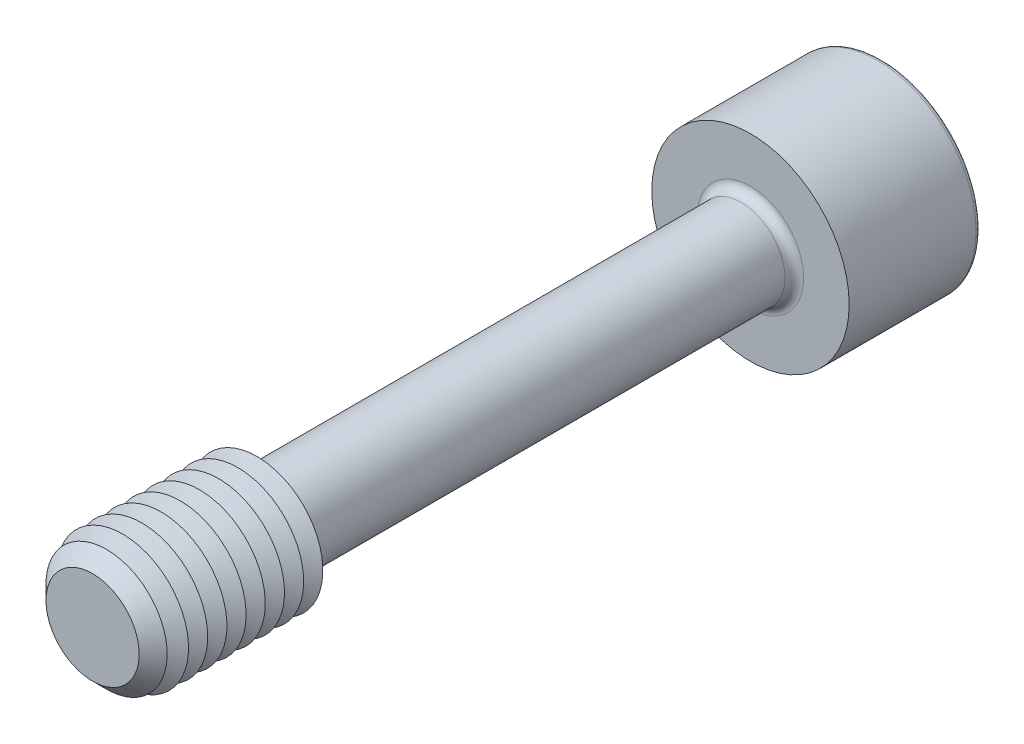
ISO-10303-21;
HEADER;
FILE_DESCRIPTION(('STEP AP214'),'2;1');
FILE_NAME('part.step','',(''),(''),'','','');
FILE_SCHEMA(('AUTOMOTIVE_DESIGN { 1 0 10303 214 1 1 1 1 }'));
ENDSEC;
DATA;
#1=APPLICATION_CONTEXT('core data for automotive mechanical design processes');
#2=APPLICATION_PROTOCOL_DEFINITION('international standard','automotive_design',2000,#1);
#3=PRODUCT_CONTEXT('',#1,'mechanical');
#4=PRODUCT('Part','Part','',(#3));
#5=PRODUCT_RELATED_PRODUCT_CATEGORY('part','',(#4));
#6=PRODUCT_DEFINITION_FORMATION('','',#4);
#7=PRODUCT_DEFINITION_CONTEXT('part definition',#1,'design');
#8=PRODUCT_DEFINITION('design','',#6,#7);
#9=PRODUCT_DEFINITION_SHAPE('','',#8);
#10=(LENGTH_UNIT() NAMED_UNIT(*) SI_UNIT(.MILLI.,.METRE.));
#11=(NAMED_UNIT(*) PLANE_ANGLE_UNIT() SI_UNIT($,.RADIAN.));
#12=(NAMED_UNIT(*) SI_UNIT($,.STERADIAN.) SOLID_ANGLE_UNIT());
#13=UNCERTAINTY_MEASURE_WITH_UNIT(LENGTH_MEASURE(1.E-05),#10,'distance_accuracy_value','');
#14=(GEOMETRIC_REPRESENTATION_CONTEXT(3) GLOBAL_UNCERTAINTY_ASSIGNED_CONTEXT((#13)) GLOBAL_UNIT_ASSIGNED_CONTEXT((#10,
#11,#12)) REPRESENTATION_CONTEXT('',''));
#15=CARTESIAN_POINT('',(0.,0.,0.));
#16=DIRECTION('',(0.,0.,1.));
#17=DIRECTION('',(1.,0.,0.));
#18=AXIS2_PLACEMENT_3D('',#15,#16,#17);
#19=CARTESIAN_POINT('',(-2.88675134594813,-5.,-32.));
#20=DIRECTION('',(0.,0.,1.));
#21=DIRECTION('',(1.,0.,0.));
#22=AXIS2_PLACEMENT_3D('',#19,#20,#21);
#23=PLANE('',#22);
#24=DIRECTION('',(1.,0.,0.));
#25=VECTOR('',#24,1.);
#26=CARTESIAN_POINT('',(-2.88675134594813,-5.,-32.));
#27=LINE('',#26,#25);
#28=CARTESIAN_POINT('',(0.,-5.,-32.));
#29=VERTEX_POINT('',#28);
#30=CARTESIAN_POINT('',(2.88675134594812,-5.,-32.));
#31=VERTEX_POINT('',#30);
#32=EDGE_CURVE('E762',#29,#31,#27,.T.);
#33=ORIENTED_EDGE('',*,*,#32,.F.);
#34=CARTESIAN_POINT('',(0.,0.,-32.));
#35=DIRECTION('',(0.,0.,1.));
#36=DIRECTION('',(0.,-1.,0.));
#37=AXIS2_PLACEMENT_3D('',#34,#35,#36);
#38=CIRCLE('',#37,5.);
#39=CARTESIAN_POINT('',(4.3301270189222,-2.5,-32.));
#40=VERTEX_POINT('',#39);
#41=EDGE_CURVE('E53',#29,#40,#38,.T.);
#42=ORIENTED_EDGE('',*,*,#41,.T.);
#43=DIRECTION('',(0.5,0.866025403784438,0.));
#44=VECTOR('',#43,1.);
#45=CARTESIAN_POINT('',(2.88675134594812,-5.,-32.));
#46=LINE('',#45,#44);
#47=EDGE_CURVE('E747',#31,#40,#46,.T.);
#48=ORIENTED_EDGE('',*,*,#47,.F.);
#49=EDGE_LOOP('',(#33,#42,#48));
#50=FACE_BOUND('',#49,.T.);
#51=ADVANCED_FACE('F41',(#50),#23,.F.);
#52=CARTESIAN_POINT('',(5.77350269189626,0.,-32.));
#53=VERTEX_POINT('',#52);
#54=EDGE_CURVE('E758',#40,#53,#46,.T.);
#55=ORIENTED_EDGE('',*,*,#54,.F.);
#56=CARTESIAN_POINT('',(4.3301270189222,2.50000000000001,-32.));
#57=VERTEX_POINT('',#56);
#58=EDGE_CURVE('E11',#40,#57,#38,.T.);
#59=ORIENTED_EDGE('',*,*,#58,.T.);
#60=DIRECTION('',(-0.5,0.866025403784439,0.));
#61=VECTOR('',#60,1.);
#62=CARTESIAN_POINT('',(5.77350269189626,0.,-32.));
#63=LINE('',#62,#61);
#64=EDGE_CURVE('E746',#53,#57,#63,.T.);
#65=ORIENTED_EDGE('',*,*,#64,.F.);
#66=EDGE_LOOP('',(#55,#59,#65));
#67=FACE_BOUND('',#66,.T.);
#68=ADVANCED_FACE('F133',(#67),#23,.F.);
#69=CARTESIAN_POINT('',(2.88675134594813,5.,-32.));
#70=VERTEX_POINT('',#69);
#71=EDGE_CURVE('E741',#57,#70,#63,.T.);
#72=ORIENTED_EDGE('',*,*,#71,.F.);
#73=CARTESIAN_POINT('',(0.,5.00000000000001,-32.));
#74=VERTEX_POINT('',#73);
#75=EDGE_CURVE('E51',#57,#74,#38,.T.);
#76=ORIENTED_EDGE('',*,*,#75,.T.);
#77=DIRECTION('',(-1.,0.,0.));
#78=VECTOR('',#77,1.);
#79=CARTESIAN_POINT('',(2.88675134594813,5.,-32.));
#80=LINE('',#79,#78);
#81=EDGE_CURVE('E177',#70,#74,#80,.T.);
#82=ORIENTED_EDGE('',*,*,#81,.F.);
#83=EDGE_LOOP('',(#72,#76,#82));
#84=FACE_BOUND('',#83,.T.);
#85=ADVANCED_FACE('F139',(#84),#23,.F.);
#86=CARTESIAN_POINT('',(-2.88675134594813,5.,-32.));
#87=VERTEX_POINT('',#86);
#88=EDGE_CURVE('E752',#74,#87,#80,.T.);
#89=ORIENTED_EDGE('',*,*,#88,.F.);
#90=CARTESIAN_POINT('',(-4.3301270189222,2.50000000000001,-32.));
#91=VERTEX_POINT('',#90);
#92=EDGE_CURVE('E265',#74,#91,#38,.T.);
#93=ORIENTED_EDGE('',*,*,#92,.T.);
#94=DIRECTION('',(-0.5,-0.866025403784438,0.));
#95=VECTOR('',#94,1.);
#96=CARTESIAN_POINT('',(-2.88675134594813,5.,-32.));
#97=LINE('',#96,#95);
#98=EDGE_CURVE('E176',#87,#91,#97,.T.);
#99=ORIENTED_EDGE('',*,*,#98,.F.);
#100=EDGE_LOOP('',(#89,#93,#99));
#101=FACE_BOUND('',#100,.T.);
#102=ADVANCED_FACE('F157',(#101),#23,.F.);
#103=CARTESIAN_POINT('',(-5.77350269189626,0.,-32.));
#104=VERTEX_POINT('',#103);
#105=EDGE_CURVE('E170',#91,#104,#97,.T.);
#106=ORIENTED_EDGE('',*,*,#105,.F.);
#107=CARTESIAN_POINT('',(-4.3301270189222,-2.5,-32.));
#108=VERTEX_POINT('',#107);
#109=EDGE_CURVE('E172',#91,#108,#38,.T.);
#110=ORIENTED_EDGE('',*,*,#109,.T.);
#111=DIRECTION('',(0.5,-0.866025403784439,0.));
#112=VECTOR('',#111,1.);
#113=CARTESIAN_POINT('',(-5.77350269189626,0.,-32.));
#114=LINE('',#113,#112);
#115=EDGE_CURVE('E174',#104,#108,#114,.T.);
#116=ORIENTED_EDGE('',*,*,#115,.F.);
#117=EDGE_LOOP('',(#106,#110,#116));
#118=FACE_BOUND('',#117,.T.);
#119=ADVANCED_FACE('F146',(#118),#23,.F.);
#120=CARTESIAN_POINT('',(0.,0.,-42.));
#121=DIRECTION('',(0.,0.,-1.));
#122=DIRECTION('',(-1.,0.,0.));
#123=AXIS2_PLACEMENT_3D('',#120,#121,#122);
#124=PLANE('',#123);
#125=CARTESIAN_POINT('',(0.,0.,-42.));
#126=DIRECTION('',(0.,0.,-1.));
#127=DIRECTION('',(-1.,0.,0.));
#128=AXIS2_PLACEMENT_3D('',#125,#126,#127);
#129=CIRCLE('',#128,8.575);
#130=CARTESIAN_POINT('',(-8.575,0.,-42.));
#131=VERTEX_POINT('',#130);
#132=EDGE_CURVE('E251',#131,#131,#129,.T.);
#133=ORIENTED_EDGE('',*,*,#132,.T.);
#134=EDGE_LOOP('',(#133));
#135=FACE_BOUND('',#134,.T.);
#136=DIRECTION('',(-0.5,-0.866025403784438,0.));
#137=VECTOR('',#136,1.);
#138=CARTESIAN_POINT('',(-2.88675134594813,5.,-42.));
#139=LINE('',#138,#137);
#140=CARTESIAN_POINT('',(-2.88675134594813,5.,-42.));
#141=VERTEX_POINT('',#140);
#142=CARTESIAN_POINT('',(-5.77350269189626,0.,-42.));
#143=VERTEX_POINT('',#142);
#144=EDGE_CURVE('E212',#141,#143,#139,.T.);
#145=ORIENTED_EDGE('',*,*,#144,.T.);
#146=DIRECTION('',(0.5,-0.866025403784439,0.));
#147=VECTOR('',#146,1.);
#148=CARTESIAN_POINT('',(-5.77350269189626,0.,-42.));
#149=LINE('',#148,#147);
#150=CARTESIAN_POINT('',(-2.88675134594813,-5.,-42.));
#151=VERTEX_POINT('',#150);
#152=EDGE_CURVE('E67',#143,#151,#149,.T.);
#153=ORIENTED_EDGE('',*,*,#152,.T.);
#154=DIRECTION('',(1.,0.,0.));
#155=VECTOR('',#154,1.);
#156=CARTESIAN_POINT('',(-2.88675134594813,-5.,-42.));
#157=LINE('',#156,#155);
#158=CARTESIAN_POINT('',(2.88675134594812,-5.,-42.));
#159=VERTEX_POINT('',#158);
#160=EDGE_CURVE('E196',#151,#159,#157,.T.);
#161=ORIENTED_EDGE('',*,*,#160,.T.);
#162=DIRECTION('',(0.5,0.866025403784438,0.));
#163=VECTOR('',#162,1.);
#164=CARTESIAN_POINT('',(2.88675134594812,-5.,-42.));
#165=LINE('',#164,#163);
#166=CARTESIAN_POINT('',(5.77350269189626,0.,-42.));
#167=VERTEX_POINT('',#166);
#168=EDGE_CURVE('E200',#159,#167,#165,.T.);
#169=ORIENTED_EDGE('',*,*,#168,.T.);
#170=DIRECTION('',(-0.5,0.866025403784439,0.));
#171=VECTOR('',#170,1.);
#172=CARTESIAN_POINT('',(5.77350269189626,0.,-42.));
#173=LINE('',#172,#171);
#174=CARTESIAN_POINT('',(2.88675134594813,5.,-42.));
#175=VERTEX_POINT('',#174);
#176=EDGE_CURVE('E204',#167,#175,#173,.T.);
#177=ORIENTED_EDGE('',*,*,#176,.T.);
#178=DIRECTION('',(-1.,0.,0.));
#179=VECTOR('',#178,1.);
#180=CARTESIAN_POINT('',(2.88675134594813,5.,-42.));
#181=LINE('',#180,#179);
#182=EDGE_CURVE('E208',#175,#141,#181,.T.);
#183=ORIENTED_EDGE('',*,*,#182,.T.);
#184=EDGE_LOOP('',(#145,#153,#161,#169,#177,#183));
#185=FACE_BOUND('',#184,.T.);
#186=ADVANCED_FACE('F156',(#135,#185),#124,.T.);
#187=CARTESIAN_POINT('',(0.,0.,30.));
#188=DIRECTION('',(0.,0.,-1.));
#189=DIRECTION('',(-1.,0.,0.));
#190=AXIS2_PLACEMENT_3D('',#187,#188,#189);
#191=CYLINDRICAL_SURFACE('',#190,4.);
#192=CARTESIAN_POINT('',(0.,0.,-29.15));
#193=DIRECTION('',(0.,0.,-1.));
#194=DIRECTION('',(-1.,0.,0.));
#195=AXIS2_PLACEMENT_3D('',#192,#193,#194);
#196=CIRCLE('',#195,4.);
#197=CARTESIAN_POINT('',(-4.,0.,-29.15));
#198=VERTEX_POINT('',#197);
#199=EDGE_CURVE('E247',#198,#198,#196,.F.);
#200=ORIENTED_EDGE('',*,*,#199,.T.);
#201=EDGE_LOOP('',(#200));
#202=FACE_BOUND('',#201,.T.);
#203=CARTESIAN_POINT('',(0.,0.,13.8452994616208));
#204=DIRECTION('',(0.,0.,-1.));
#205=DIRECTION('',(0.,1.,0.));
#206=AXIS2_PLACEMENT_3D('',#203,#204,#205);
#207=CIRCLE('',#206,4.);
#208=CARTESIAN_POINT('',(0.,4.,13.8452994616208));
#209=VERTEX_POINT('',#208);
#210=EDGE_CURVE('E235',#209,#209,#207,.T.);
#211=ORIENTED_EDGE('',*,*,#210,.T.);
#212=EDGE_LOOP('',(#211));
#213=FACE_BOUND('',#212,.T.);
#214=ADVANCED_FACE('F163',(#202,#213),#191,.T.);
#215=CARTESIAN_POINT('',(0.,0.,13.8452994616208));
#216=DIRECTION('',(0.,0.,1.));
#217=DIRECTION('',(0.,-1.,0.));
#218=AXIS2_PLACEMENT_3D('',#215,#216,#217);
#219=CONICAL_SURFACE('',#218,4.,1.0471975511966);
#220=CARTESIAN_POINT('',(0.,0.,15.));
#221=DIRECTION('',(0.,0.,-1.));
#222=DIRECTION('',(-1.,0.,0.));
#223=AXIS2_PLACEMENT_3D('',#220,#221,#222);
#224=CIRCLE('',#223,6.);
#225=CARTESIAN_POINT('',(-6.,0.,15.));
#226=VERTEX_POINT('',#225);
#227=EDGE_CURVE('E269',#226,#226,#224,.T.);
#228=ORIENTED_EDGE('',*,*,#227,.T.);
#229=EDGE_LOOP('',(#228));
#230=FACE_BOUND('',#229,.T.);
#231=ORIENTED_EDGE('',*,*,#210,.F.);
#232=EDGE_LOOP('',(#231));
#233=FACE_BOUND('',#232,.T.);
#234=ADVANCED_FACE('F510',(#230,#233),#219,.T.);
#235=CARTESIAN_POINT('',(0.,0.,-30.));
#236=DIRECTION('',(0.,0.,-1.));
#237=DIRECTION('',(-1.,0.,0.));
#238=AXIS2_PLACEMENT_3D('',#235,#236,#237);
#239=PLANE('',#238);
#240=CARTESIAN_POINT('',(0.,0.,-30.));
#241=DIRECTION('',(0.,0.,-1.));
#242=DIRECTION('',(-1.,0.,0.));
#243=AXIS2_PLACEMENT_3D('',#240,#241,#242);
#244=CIRCLE('',#243,4.85);
#245=CARTESIAN_POINT('',(-4.85,0.,-30.));
#246=VERTEX_POINT('',#245);
#247=EDGE_CURVE('E243',#246,#246,#244,.T.);
#248=ORIENTED_EDGE('',*,*,#247,.T.);
#249=EDGE_LOOP('',(#248));
#250=FACE_BOUND('',#249,.T.);
#251=CARTESIAN_POINT('',(0.,0.,-30.));
#252=DIRECTION('',(0.,0.,-1.));
#253=DIRECTION('',(-1.,0.,0.));
#254=AXIS2_PLACEMENT_3D('',#251,#252,#253);
#255=CIRCLE('',#254,9.);
#256=CARTESIAN_POINT('',(-9.,0.,-30.));
#257=VERTEX_POINT('',#256);
#258=EDGE_CURVE('E231',#257,#257,#255,.T.);
#259=ORIENTED_EDGE('',*,*,#258,.F.);
#260=EDGE_LOOP('',(#259));
#261=FACE_BOUND('',#260,.T.);
#262=ADVANCED_FACE('F503',(#250,#261),#239,.F.);
#263=CARTESIAN_POINT('',(0.,0.,-42.));
#264=DIRECTION('',(0.,0.,1.));
#265=DIRECTION('',(1.,0.,0.));
#266=AXIS2_PLACEMENT_3D('',#263,#264,#265);
#267=CYLINDRICAL_SURFACE('',#266,9.);
#268=CARTESIAN_POINT('',(0.,0.,-41.575));
#269=DIRECTION('',(0.,0.,-1.));
#270=DIRECTION('',(-1.,0.,0.));
#271=AXIS2_PLACEMENT_3D('',#268,#269,#270);
#272=CIRCLE('',#271,9.);
#273=CARTESIAN_POINT('',(-9.,0.,-41.575));
#274=VERTEX_POINT('',#273);
#275=EDGE_CURVE('E254',#274,#274,#272,.F.);
#276=ORIENTED_EDGE('',*,*,#275,.T.);
#277=EDGE_LOOP('',(#276));
#278=FACE_BOUND('',#277,.T.);
#279=ORIENTED_EDGE('',*,*,#258,.T.);
#280=EDGE_LOOP('',(#279));
#281=FACE_BOUND('',#280,.T.);
#282=ADVANCED_FACE('F509',(#278,#281),#267,.T.);
#283=CARTESIAN_POINT('',(-5.77350269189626,0.,-32.));
#284=DIRECTION('',(0.866025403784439,0.5,0.));
#285=DIRECTION('',(-0.5,0.866025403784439,0.));
#286=AXIS2_PLACEMENT_3D('',#283,#284,#285);
#287=PLANE('',#286);
#288=ORIENTED_EDGE('',*,*,#152,.F.);
#289=DIRECTION('',(0.,0.,-1.));
#290=VECTOR('',#289,1.);
#291=CARTESIAN_POINT('',(-5.77350269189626,0.,-32.));
#292=LINE('',#291,#290);
#293=EDGE_CURVE('E186',#104,#143,#292,.T.);
#294=ORIENTED_EDGE('',*,*,#293,.F.);
#295=ORIENTED_EDGE('',*,*,#115,.T.);
#296=CARTESIAN_POINT('',(-2.88675134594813,-5.,-32.));
#297=VERTEX_POINT('',#296);
#298=EDGE_CURVE('E215',#108,#297,#114,.T.);
#299=ORIENTED_EDGE('',*,*,#298,.T.);
#300=DIRECTION('',(0.,0.,-1.));
#301=VECTOR('',#300,1.);
#302=CARTESIAN_POINT('',(-2.88675134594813,-5.,-32.));
#303=LINE('',#302,#301);
#304=EDGE_CURVE('E228',#297,#151,#303,.T.);
#305=ORIENTED_EDGE('',*,*,#304,.T.);
#306=EDGE_LOOP('',(#288,#294,#295,#299,#305));
#307=FACE_BOUND('',#306,.T.);
#308=ADVANCED_FACE('F521',(#307),#287,.T.);
#309=CARTESIAN_POINT('',(-2.88675134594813,-5.,-32.));
#310=DIRECTION('',(0.,1.,0.));
#311=DIRECTION('',(0.,0.,1.));
#312=AXIS2_PLACEMENT_3D('',#309,#310,#311);
#313=PLANE('',#312);
#314=ORIENTED_EDGE('',*,*,#160,.F.);
#315=ORIENTED_EDGE('',*,*,#304,.F.);
#316=EDGE_CURVE('E759',#297,#29,#27,.T.);
#317=ORIENTED_EDGE('',*,*,#316,.T.);
#318=ORIENTED_EDGE('',*,*,#32,.T.);
#319=DIRECTION('',(0.,0.,-1.));
#320=VECTOR('',#319,1.);
#321=CARTESIAN_POINT('',(2.88675134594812,-5.,-32.));
#322=LINE('',#321,#320);
#323=EDGE_CURVE('E225',#31,#159,#322,.T.);
#324=ORIENTED_EDGE('',*,*,#323,.T.);
#325=EDGE_LOOP('',(#314,#315,#317,#318,#324));
#326=FACE_BOUND('',#325,.T.);
#327=ADVANCED_FACE('F537',(#326),#313,.T.);
#328=CARTESIAN_POINT('',(2.88675134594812,-5.,-32.));
#329=DIRECTION('',(-0.866025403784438,0.5,0.));
#330=DIRECTION('',(-0.5,-0.866025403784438,0.));
#331=AXIS2_PLACEMENT_3D('',#328,#329,#330);
#332=PLANE('',#331);
#333=ORIENTED_EDGE('',*,*,#168,.F.);
#334=ORIENTED_EDGE('',*,*,#323,.F.);
#335=ORIENTED_EDGE('',*,*,#47,.T.);
#336=ORIENTED_EDGE('',*,*,#54,.T.);
#337=DIRECTION('',(0.,0.,-1.));
#338=VECTOR('',#337,1.);
#339=CARTESIAN_POINT('',(5.77350269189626,0.,-32.));
#340=LINE('',#339,#338);
#341=EDGE_CURVE('E222',#53,#167,#340,.T.);
#342=ORIENTED_EDGE('',*,*,#341,.T.);
#343=EDGE_LOOP('',(#333,#334,#335,#336,#342));
#344=FACE_BOUND('',#343,.T.);
#345=ADVANCED_FACE('F547',(#344),#332,.T.);
#346=CARTESIAN_POINT('',(5.77350269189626,0.,-32.));
#347=DIRECTION('',(-0.866025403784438,-0.5,0.));
#348=DIRECTION('',(0.5,-0.866025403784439,0.));
#349=AXIS2_PLACEMENT_3D('',#346,#347,#348);
#350=PLANE('',#349);
#351=ORIENTED_EDGE('',*,*,#176,.F.);
#352=ORIENTED_EDGE('',*,*,#341,.F.);
#353=ORIENTED_EDGE('',*,*,#64,.T.);
#354=ORIENTED_EDGE('',*,*,#71,.T.);
#355=DIRECTION('',(0.,0.,-1.));
#356=VECTOR('',#355,1.);
#357=CARTESIAN_POINT('',(2.88675134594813,5.,-32.));
#358=LINE('',#357,#356);
#359=EDGE_CURVE('E219',#70,#175,#358,.T.);
#360=ORIENTED_EDGE('',*,*,#359,.T.);
#361=EDGE_LOOP('',(#351,#352,#353,#354,#360));
#362=FACE_BOUND('',#361,.T.);
#363=ADVANCED_FACE('F557',(#362),#350,.T.);
#364=CARTESIAN_POINT('',(2.88675134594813,5.,-32.));
#365=DIRECTION('',(0.,-1.,0.));
#366=DIRECTION('',(0.,0.,-1.));
#367=AXIS2_PLACEMENT_3D('',#364,#365,#366);
#368=PLANE('',#367);
#369=ORIENTED_EDGE('',*,*,#182,.F.);
#370=ORIENTED_EDGE('',*,*,#359,.F.);
#371=ORIENTED_EDGE('',*,*,#81,.T.);
#372=ORIENTED_EDGE('',*,*,#88,.T.);
#373=DIRECTION('',(0.,0.,-1.));
#374=VECTOR('',#373,1.);
#375=CARTESIAN_POINT('',(-2.88675134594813,5.,-32.));
#376=LINE('',#375,#374);
#377=EDGE_CURVE('E182',#87,#141,#376,.T.);
#378=ORIENTED_EDGE('',*,*,#377,.T.);
#379=EDGE_LOOP('',(#369,#370,#371,#372,#378));
#380=FACE_BOUND('',#379,.T.);
#381=ADVANCED_FACE('F152',(#380),#368,.T.);
#382=CARTESIAN_POINT('',(-2.88675134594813,5.,-32.));
#383=DIRECTION('',(0.866025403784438,-0.5,0.));
#384=DIRECTION('',(0.5,0.866025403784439,0.));
#385=AXIS2_PLACEMENT_3D('',#382,#383,#384);
#386=PLANE('',#385);
#387=ORIENTED_EDGE('',*,*,#144,.F.);
#388=ORIENTED_EDGE('',*,*,#377,.F.);
#389=ORIENTED_EDGE('',*,*,#98,.T.);
#390=ORIENTED_EDGE('',*,*,#105,.T.);
#391=ORIENTED_EDGE('',*,*,#293,.T.);
#392=EDGE_LOOP('',(#387,#388,#389,#390,#391));
#393=FACE_BOUND('',#392,.T.);
#394=ADVANCED_FACE('F144',(#393),#386,.T.);
#395=ORIENTED_EDGE('',*,*,#298,.F.);
#396=EDGE_CURVE('E257',#108,#29,#38,.T.);
#397=ORIENTED_EDGE('',*,*,#396,.T.);
#398=ORIENTED_EDGE('',*,*,#316,.F.);
#399=EDGE_LOOP('',(#395,#397,#398));
#400=FACE_BOUND('',#399,.T.);
#401=ADVANCED_FACE('F135',(#400),#23,.F.);
#402=CARTESIAN_POINT('',(0.,0.,-29.15));
#403=DIRECTION('',(0.,0.,-1.));
#404=DIRECTION('',(-1.,0.,0.));
#405=AXIS2_PLACEMENT_3D('',#402,#403,#404);
#406=TOROIDAL_SURFACE('',#405,4.85,0.85);
#407=ORIENTED_EDGE('',*,*,#199,.F.);
#408=EDGE_LOOP('',(#407));
#409=FACE_BOUND('',#408,.T.);
#410=ORIENTED_EDGE('',*,*,#247,.F.);
#411=EDGE_LOOP('',(#410));
#412=FACE_BOUND('',#411,.T.);
#413=ADVANCED_FACE('F129',(#409,#412),#406,.F.);
#414=CARTESIAN_POINT('',(0.,0.,-41.575));
#415=DIRECTION('',(0.,0.,-1.));
#416=DIRECTION('',(-1.,0.,0.));
#417=AXIS2_PLACEMENT_3D('',#414,#415,#416);
#418=TOROIDAL_SURFACE('',#417,8.575,0.425);
#419=ORIENTED_EDGE('',*,*,#275,.F.);
#420=EDGE_LOOP('',(#419));
#421=FACE_BOUND('',#420,.T.);
#422=ORIENTED_EDGE('',*,*,#132,.F.);
#423=EDGE_LOOP('',(#422));
#424=FACE_BOUND('',#423,.T.);
#425=ADVANCED_FACE('F43',(#421,#424),#418,.T.);
#426=CARTESIAN_POINT('',(0.,0.,-29.1132486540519));
#427=DIRECTION('',(0.,0.,-1.));
#428=DIRECTION('',(0.,1.,0.));
#429=AXIS2_PLACEMENT_3D('',#426,#427,#428);
#430=CONICAL_SURFACE('',#429,0.,1.0471975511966);
#431=ORIENTED_EDGE('',*,*,#41,.F.);
#432=ORIENTED_EDGE('',*,*,#396,.F.);
#433=ORIENTED_EDGE('',*,*,#109,.F.);
#434=ORIENTED_EDGE('',*,*,#92,.F.);
#435=ORIENTED_EDGE('',*,*,#75,.F.);
#436=ORIENTED_EDGE('',*,*,#58,.F.);
#437=EDGE_LOOP('',(#431,#432,#433,#434,#435,#436));
#438=FACE_BOUND('',#437,.T.);
#439=CARTESIAN_POINT('',(0.,0.,-29.1132486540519));
#440=VERTEX_POINT('',#439);
#441=VERTEX_LOOP('',#440);
#442=FACE_BOUND('',#441,.T.);
#443=ADVANCED_FACE('F118',(#438,#442),#430,.F.);
#444=CARTESIAN_POINT('',(0.,0.,15.875));
#445=DIRECTION('',(0.,0.,-1.));
#446=DIRECTION('',(-1.,0.,0.));
#447=AXIS2_PLACEMENT_3D('',#444,#445,#446);
#448=CONICAL_SURFACE('',#447,4.48445554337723,1.0471975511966);
#449=ORIENTED_EDGE('',*,*,#227,.F.);
#450=EDGE_LOOP('',(#449));
#451=FACE_BOUND('',#450,.T.);
#452=CARTESIAN_POINT('',(0.,0.,15.875));
#453=DIRECTION('',(0.,0.,-1.));
#454=DIRECTION('',(-1.,0.,0.));
#455=AXIS2_PLACEMENT_3D('',#452,#453,#454);
#456=CIRCLE('',#455,4.48445554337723);
#457=CARTESIAN_POINT('',(-4.48445554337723,0.,15.875));
#458=VERTEX_POINT('',#457);
#459=EDGE_CURVE('E275',#458,#458,#456,.T.);
#460=ORIENTED_EDGE('',*,*,#459,.T.);
#461=EDGE_LOOP('',(#460));
#462=FACE_BOUND('',#461,.T.);
#463=ADVANCED_FACE('F120',(#451,#462),#448,.T.);
#464=CARTESIAN_POINT('',(0.,0.,16.75));
#465=DIRECTION('',(0.,0.,1.));
#466=DIRECTION('',(1.,0.,0.));
#467=AXIS2_PLACEMENT_3D('',#464,#465,#466);
#468=CONICAL_SURFACE('',#467,6.,1.0471975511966);
#469=ORIENTED_EDGE('',*,*,#459,.F.);
#470=EDGE_LOOP('',(#469));
#471=FACE_BOUND('',#470,.T.);
#472=CARTESIAN_POINT('',(0.,0.,16.75));
#473=DIRECTION('',(0.,0.,-1.));
#474=DIRECTION('',(-1.,0.,0.));
#475=AXIS2_PLACEMENT_3D('',#472,#473,#474);
#476=CIRCLE('',#475,6.);
#477=CARTESIAN_POINT('',(-6.,0.,16.75));
#478=VERTEX_POINT('',#477);
#479=EDGE_CURVE('E280',#478,#478,#476,.T.);
#480=ORIENTED_EDGE('',*,*,#479,.T.);
#481=EDGE_LOOP('',(#480));
#482=FACE_BOUND('',#481,.T.);
#483=ADVANCED_FACE('F126',(#471,#482),#468,.T.);
#484=CARTESIAN_POINT('',(0.,0.,17.625));
#485=DIRECTION('',(0.,0.,-1.));
#486=DIRECTION('',(-1.,0.,0.));
#487=AXIS2_PLACEMENT_3D('',#484,#485,#486);
#488=CONICAL_SURFACE('',#487,4.48445554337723,1.0471975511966);
#489=ORIENTED_EDGE('',*,*,#479,.F.);
#490=EDGE_LOOP('',(#489));
#491=FACE_BOUND('',#490,.T.);
#492=CARTESIAN_POINT('',(0.,0.,17.625));
#493=DIRECTION('',(0.,0.,-1.));
#494=DIRECTION('',(-1.,0.,0.));
#495=AXIS2_PLACEMENT_3D('',#492,#493,#494);
#496=CIRCLE('',#495,4.48445554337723);
#497=CARTESIAN_POINT('',(-4.48445554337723,0.,17.625));
#498=VERTEX_POINT('',#497);
#499=EDGE_CURVE('E286',#498,#498,#496,.T.);
#500=ORIENTED_EDGE('',*,*,#499,.T.);
#501=EDGE_LOOP('',(#500));
#502=FACE_BOUND('',#501,.T.);
#503=ADVANCED_FACE('F397',(#491,#502),#488,.T.);
#504=CARTESIAN_POINT('',(0.,0.,18.5));
#505=DIRECTION('',(0.,0.,1.));
#506=DIRECTION('',(1.,0.,0.));
#507=AXIS2_PLACEMENT_3D('',#504,#505,#506);
#508=CONICAL_SURFACE('',#507,6.,1.0471975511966);
#509=ORIENTED_EDGE('',*,*,#499,.F.);
#510=EDGE_LOOP('',(#509));
#511=FACE_BOUND('',#510,.T.);
#512=CARTESIAN_POINT('',(0.,0.,18.5));
#513=DIRECTION('',(0.,0.,-1.));
#514=DIRECTION('',(-1.,0.,0.));
#515=AXIS2_PLACEMENT_3D('',#512,#513,#514);
#516=CIRCLE('',#515,6.);
#517=CARTESIAN_POINT('',(-6.,0.,18.5));
#518=VERTEX_POINT('',#517);
#519=EDGE_CURVE('E290',#518,#518,#516,.T.);
#520=ORIENTED_EDGE('',*,*,#519,.T.);
#521=EDGE_LOOP('',(#520));
#522=FACE_BOUND('',#521,.T.);
#523=ADVANCED_FACE('F393',(#511,#522),#508,.T.);
#524=CARTESIAN_POINT('',(0.,0.,19.375));
#525=DIRECTION('',(0.,0.,-1.));
#526=DIRECTION('',(-1.,0.,0.));
#527=AXIS2_PLACEMENT_3D('',#524,#525,#526);
#528=CONICAL_SURFACE('',#527,4.48445554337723,1.0471975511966);
#529=ORIENTED_EDGE('',*,*,#519,.F.);
#530=EDGE_LOOP('',(#529));
#531=FACE_BOUND('',#530,.T.);
#532=CARTESIAN_POINT('',(0.,0.,19.375));
#533=DIRECTION('',(0.,0.,-1.));
#534=DIRECTION('',(-1.,0.,0.));
#535=AXIS2_PLACEMENT_3D('',#532,#533,#534);
#536=CIRCLE('',#535,4.48445554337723);
#537=CARTESIAN_POINT('',(-4.48445554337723,0.,19.375));
#538=VERTEX_POINT('',#537);
#539=EDGE_CURVE('E294',#538,#538,#536,.T.);
#540=ORIENTED_EDGE('',*,*,#539,.T.);
#541=EDGE_LOOP('',(#540));
#542=FACE_BOUND('',#541,.T.);
#543=ADVANCED_FACE('F389',(#531,#542),#528,.T.);
#544=CARTESIAN_POINT('',(0.,0.,20.25));
#545=DIRECTION('',(0.,0.,1.));
#546=DIRECTION('',(1.,0.,0.));
#547=AXIS2_PLACEMENT_3D('',#544,#545,#546);
#548=CONICAL_SURFACE('',#547,6.,1.0471975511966);
#549=ORIENTED_EDGE('',*,*,#539,.F.);
#550=EDGE_LOOP('',(#549));
#551=FACE_BOUND('',#550,.T.);
#552=CARTESIAN_POINT('',(0.,0.,20.25));
#553=DIRECTION('',(0.,0.,-1.));
#554=DIRECTION('',(-1.,0.,0.));
#555=AXIS2_PLACEMENT_3D('',#552,#553,#554);
#556=CIRCLE('',#555,6.);
#557=CARTESIAN_POINT('',(-6.,0.,20.25));
#558=VERTEX_POINT('',#557);
#559=EDGE_CURVE('E297',#558,#558,#556,.T.);
#560=ORIENTED_EDGE('',*,*,#559,.T.);
#561=EDGE_LOOP('',(#560));
#562=FACE_BOUND('',#561,.T.);
#563=ADVANCED_FACE('F385',(#551,#562),#548,.T.);
#564=CARTESIAN_POINT('',(0.,0.,21.125));
#565=DIRECTION('',(0.,0.,-1.));
#566=DIRECTION('',(-1.,0.,0.));
#567=AXIS2_PLACEMENT_3D('',#564,#565,#566);
#568=CONICAL_SURFACE('',#567,4.48445554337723,1.0471975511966);
#569=ORIENTED_EDGE('',*,*,#559,.F.);
#570=EDGE_LOOP('',(#569));
#571=FACE_BOUND('',#570,.T.);
#572=CARTESIAN_POINT('',(0.,0.,21.125));
#573=DIRECTION('',(0.,0.,-1.));
#574=DIRECTION('',(-1.,0.,0.));
#575=AXIS2_PLACEMENT_3D('',#572,#573,#574);
#576=CIRCLE('',#575,4.48445554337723);
#577=CARTESIAN_POINT('',(-4.48445554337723,0.,21.125));
#578=VERTEX_POINT('',#577);
#579=EDGE_CURVE('E301',#578,#578,#576,.T.);
#580=ORIENTED_EDGE('',*,*,#579,.T.);
#581=EDGE_LOOP('',(#580));
#582=FACE_BOUND('',#581,.T.);
#583=ADVANCED_FACE('F381',(#571,#582),#568,.T.);
#584=CARTESIAN_POINT('',(0.,0.,22.));
#585=DIRECTION('',(0.,0.,1.));
#586=DIRECTION('',(1.,0.,0.));
#587=AXIS2_PLACEMENT_3D('',#584,#585,#586);
#588=CONICAL_SURFACE('',#587,6.,1.0471975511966);
#589=ORIENTED_EDGE('',*,*,#579,.F.);
#590=EDGE_LOOP('',(#589));
#591=FACE_BOUND('',#590,.T.);
#592=CARTESIAN_POINT('',(0.,0.,22.));
#593=DIRECTION('',(0.,0.,-1.));
#594=DIRECTION('',(-1.,0.,0.));
#595=AXIS2_PLACEMENT_3D('',#592,#593,#594);
#596=CIRCLE('',#595,6.);
#597=CARTESIAN_POINT('',(-6.,0.,22.));
#598=VERTEX_POINT('',#597);
#599=EDGE_CURVE('E305',#598,#598,#596,.T.);
#600=ORIENTED_EDGE('',*,*,#599,.T.);
#601=EDGE_LOOP('',(#600));
#602=FACE_BOUND('',#601,.T.);
#603=ADVANCED_FACE('F377',(#591,#602),#588,.T.);
#604=CARTESIAN_POINT('',(0.,0.,22.875));
#605=DIRECTION('',(0.,0.,-1.));
#606=DIRECTION('',(-1.,0.,0.));
#607=AXIS2_PLACEMENT_3D('',#604,#605,#606);
#608=CONICAL_SURFACE('',#607,4.48445554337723,1.0471975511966);
#609=ORIENTED_EDGE('',*,*,#599,.F.);
#610=EDGE_LOOP('',(#609));
#611=FACE_BOUND('',#610,.T.);
#612=CARTESIAN_POINT('',(0.,0.,22.875));
#613=DIRECTION('',(0.,0.,-1.));
#614=DIRECTION('',(-1.,0.,0.));
#615=AXIS2_PLACEMENT_3D('',#612,#613,#614);
#616=CIRCLE('',#615,4.48445554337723);
#617=CARTESIAN_POINT('',(-4.48445554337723,0.,22.875));
#618=VERTEX_POINT('',#617);
#619=EDGE_CURVE('E308',#618,#618,#616,.T.);
#620=ORIENTED_EDGE('',*,*,#619,.T.);
#621=EDGE_LOOP('',(#620));
#622=FACE_BOUND('',#621,.T.);
#623=ADVANCED_FACE('F373',(#611,#622),#608,.T.);
#624=CARTESIAN_POINT('',(0.,0.,23.75));
#625=DIRECTION('',(0.,0.,1.));
#626=DIRECTION('',(1.,0.,0.));
#627=AXIS2_PLACEMENT_3D('',#624,#625,#626);
#628=CONICAL_SURFACE('',#627,6.,1.0471975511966);
#629=ORIENTED_EDGE('',*,*,#619,.F.);
#630=EDGE_LOOP('',(#629));
#631=FACE_BOUND('',#630,.T.);
#632=CARTESIAN_POINT('',(0.,0.,23.75));
#633=DIRECTION('',(0.,0.,-1.));
#634=DIRECTION('',(-1.,0.,0.));
#635=AXIS2_PLACEMENT_3D('',#632,#633,#634);
#636=CIRCLE('',#635,6.);
#637=CARTESIAN_POINT('',(-6.,0.,23.75));
#638=VERTEX_POINT('',#637);
#639=EDGE_CURVE('E311',#638,#638,#636,.T.);
#640=ORIENTED_EDGE('',*,*,#639,.T.);
#641=EDGE_LOOP('',(#640));
#642=FACE_BOUND('',#641,.T.);
#643=ADVANCED_FACE('F369',(#631,#642),#628,.T.);
#644=CARTESIAN_POINT('',(0.,0.,24.625));
#645=DIRECTION('',(0.,0.,-1.));
#646=DIRECTION('',(-1.,0.,0.));
#647=AXIS2_PLACEMENT_3D('',#644,#645,#646);
#648=CONICAL_SURFACE('',#647,4.48445554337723,1.0471975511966);
#649=ORIENTED_EDGE('',*,*,#639,.F.);
#650=EDGE_LOOP('',(#649));
#651=FACE_BOUND('',#650,.T.);
#652=CARTESIAN_POINT('',(0.,0.,24.625));
#653=DIRECTION('',(0.,0.,-1.));
#654=DIRECTION('',(-1.,0.,0.));
#655=AXIS2_PLACEMENT_3D('',#652,#653,#654);
#656=CIRCLE('',#655,4.48445554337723);
#657=CARTESIAN_POINT('',(-4.48445554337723,0.,24.625));
#658=VERTEX_POINT('',#657);
#659=EDGE_CURVE('E315',#658,#658,#656,.T.);
#660=ORIENTED_EDGE('',*,*,#659,.T.);
#661=EDGE_LOOP('',(#660));
#662=FACE_BOUND('',#661,.T.);
#663=ADVANCED_FACE('F365',(#651,#662),#648,.T.);
#664=CARTESIAN_POINT('',(0.,0.,25.5));
#665=DIRECTION('',(0.,0.,1.));
#666=DIRECTION('',(1.,0.,0.));
#667=AXIS2_PLACEMENT_3D('',#664,#665,#666);
#668=CONICAL_SURFACE('',#667,6.,1.0471975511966);
#669=ORIENTED_EDGE('',*,*,#659,.F.);
#670=EDGE_LOOP('',(#669));
#671=FACE_BOUND('',#670,.T.);
#672=CARTESIAN_POINT('',(0.,0.,25.5));
#673=DIRECTION('',(0.,0.,-1.));
#674=DIRECTION('',(-1.,0.,0.));
#675=AXIS2_PLACEMENT_3D('',#672,#673,#674);
#676=CIRCLE('',#675,6.);
#677=CARTESIAN_POINT('',(-6.,0.,25.5));
#678=VERTEX_POINT('',#677);
#679=EDGE_CURVE('E319',#678,#678,#676,.T.);
#680=ORIENTED_EDGE('',*,*,#679,.T.);
#681=EDGE_LOOP('',(#680));
#682=FACE_BOUND('',#681,.T.);
#683=ADVANCED_FACE('F361',(#671,#682),#668,.T.);
#684=CARTESIAN_POINT('',(0.,0.,26.375));
#685=DIRECTION('',(0.,0.,-1.));
#686=DIRECTION('',(-1.,0.,0.));
#687=AXIS2_PLACEMENT_3D('',#684,#685,#686);
#688=CONICAL_SURFACE('',#687,4.48445554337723,1.0471975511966);
#689=ORIENTED_EDGE('',*,*,#679,.F.);
#690=EDGE_LOOP('',(#689));
#691=FACE_BOUND('',#690,.T.);
#692=CARTESIAN_POINT('',(0.,0.,26.375));
#693=DIRECTION('',(0.,0.,-1.));
#694=DIRECTION('',(-1.,0.,0.));
#695=AXIS2_PLACEMENT_3D('',#692,#693,#694);
#696=CIRCLE('',#695,4.48445554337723);
#697=CARTESIAN_POINT('',(-4.48445554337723,0.,26.375));
#698=VERTEX_POINT('',#697);
#699=EDGE_CURVE('E323',#698,#698,#696,.T.);
#700=ORIENTED_EDGE('',*,*,#699,.T.);
#701=EDGE_LOOP('',(#700));
#702=FACE_BOUND('',#701,.T.);
#703=ADVANCED_FACE('F357',(#691,#702),#688,.T.);
#704=CARTESIAN_POINT('',(0.,0.,27.25));
#705=DIRECTION('',(0.,0.,1.));
#706=DIRECTION('',(1.,0.,0.));
#707=AXIS2_PLACEMENT_3D('',#704,#705,#706);
#708=CONICAL_SURFACE('',#707,6.,1.0471975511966);
#709=ORIENTED_EDGE('',*,*,#699,.F.);
#710=EDGE_LOOP('',(#709));
#711=FACE_BOUND('',#710,.T.);
#712=CARTESIAN_POINT('',(0.,0.,27.25));
#713=DIRECTION('',(0.,0.,-1.));
#714=DIRECTION('',(-1.,0.,0.));
#715=AXIS2_PLACEMENT_3D('',#712,#713,#714);
#716=CIRCLE('',#715,6.);
#717=CARTESIAN_POINT('',(-6.,0.,27.25));
#718=VERTEX_POINT('',#717);
#719=EDGE_CURVE('E326',#718,#718,#716,.T.);
#720=ORIENTED_EDGE('',*,*,#719,.T.);
#721=EDGE_LOOP('',(#720));
#722=FACE_BOUND('',#721,.T.);
#723=ADVANCED_FACE('F350',(#711,#722),#708,.T.);
#724=CARTESIAN_POINT('',(0.,0.,28.125));
#725=DIRECTION('',(0.,0.,-1.));
#726=DIRECTION('',(-1.,0.,0.));
#727=AXIS2_PLACEMENT_3D('',#724,#725,#726);
#728=CONICAL_SURFACE('',#727,4.48445554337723,1.0471975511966);
#729=ORIENTED_EDGE('',*,*,#719,.F.);
#730=EDGE_LOOP('',(#729));
#731=FACE_BOUND('',#730,.T.);
#732=CARTESIAN_POINT('',(0.,0.,28.125));
#733=DIRECTION('',(0.,0.,-1.));
#734=DIRECTION('',(-1.,0.,0.));
#735=AXIS2_PLACEMENT_3D('',#732,#733,#734);
#736=CIRCLE('',#735,4.48445554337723);
#737=CARTESIAN_POINT('',(-4.48445554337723,0.,28.125));
#738=VERTEX_POINT('',#737);
#739=EDGE_CURVE('E330',#738,#738,#736,.T.);
#740=ORIENTED_EDGE('',*,*,#739,.T.);
#741=EDGE_LOOP('',(#740));
#742=FACE_BOUND('',#741,.T.);
#743=ADVANCED_FACE('F336',(#731,#742),#728,.T.);
#744=CARTESIAN_POINT('',(0.,0.,29.));
#745=DIRECTION('',(0.,0.,1.));
#746=DIRECTION('',(1.,0.,0.));
#747=AXIS2_PLACEMENT_3D('',#744,#745,#746);
#748=CONICAL_SURFACE('',#747,6.,1.0471975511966);
#749=CARTESIAN_POINT('',(0.,0.,28.7254809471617));
#750=DIRECTION('',(0.,0.,1.));
#751=DIRECTION('',(1.,0.,0.));
#752=AXIS2_PLACEMENT_3D('',#749,#750,#751);
#753=CIRCLE('',#752,5.52451905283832);
#754=CARTESIAN_POINT('',(0.,5.52451905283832,28.7254809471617));
#755=VERTEX_POINT('',#754);
#756=EDGE_CURVE('E45',#755,#755,#753,.F.);
#757=ORIENTED_EDGE('',*,*,#756,.T.);
#758=EDGE_LOOP('',(#757));
#759=FACE_BOUND('',#758,.T.);
#760=ORIENTED_EDGE('',*,*,#739,.F.);
#761=EDGE_LOOP('',(#760));
#762=FACE_BOUND('',#761,.T.);
#763=ADVANCED_FACE('F338',(#759,#762),#748,.T.);
#764=CARTESIAN_POINT('',(0.,0.,30.));
#765=DIRECTION('',(0.,0.,1.));
#766=DIRECTION('',(1.,0.,0.));
#767=AXIS2_PLACEMENT_3D('',#764,#765,#766);
#768=PLANE('',#767);
#769=CARTESIAN_POINT('',(0.,0.,30.));
#770=DIRECTION('',(0.,0.,1.));
#771=DIRECTION('',(1.,0.,0.));
#772=AXIS2_PLACEMENT_3D('',#769,#770,#771);
#773=CIRCLE('',#772,4.24999999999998);
#774=CARTESIAN_POINT('',(0.,4.24999999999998,30.));
#775=VERTEX_POINT('',#774);
#776=EDGE_CURVE('E239',#775,#775,#773,.T.);
#777=ORIENTED_EDGE('',*,*,#776,.T.);
#778=EDGE_LOOP('',(#777));
#779=FACE_BOUND('',#778,.T.);
#780=ADVANCED_FACE('F340',(#779),#768,.T.);
#781=CARTESIAN_POINT('',(0.,0.,28.25));
#782=DIRECTION('',(0.,0.,-1.));
#783=DIRECTION('',(0.,1.,0.));
#784=AXIS2_PLACEMENT_3D('',#781,#782,#783);
#785=CONICAL_SURFACE('',#784,6.,0.785398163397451);
#786=CARTESIAN_POINT('',(0.,5.52451905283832,28.7254809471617));
#787=CARTESIAN_POINT('',(0.,5.51124281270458,28.7387571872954));
#788=CARTESIAN_POINT('',(0.,5.49796657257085,28.7520334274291));
#789=CARTESIAN_POINT('',(0.,5.47141409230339,28.7785859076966));
#790=CARTESIAN_POINT('',(0.,5.45813785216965,28.7918621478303));
#791=CARTESIAN_POINT('',(0.,5.43158537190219,28.8184146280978));
#792=CARTESIAN_POINT('',(0.,5.41830913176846,28.8316908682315));
#793=CARTESIAN_POINT('',(0.,5.39175665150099,28.858243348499));
#794=CARTESIAN_POINT('',(0.,5.37848041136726,28.8715195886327));
#795=CARTESIAN_POINT('',(0.,5.35192793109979,28.8980720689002));
#796=CARTESIAN_POINT('',(0.,5.33865169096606,28.9113483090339));
#797=CARTESIAN_POINT('',(0.,5.31209921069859,28.9379007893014));
#798=CARTESIAN_POINT('',(0.,5.29882297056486,28.9511770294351));
#799=CARTESIAN_POINT('',(0.,5.2722704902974,28.9777295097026));
#800=CARTESIAN_POINT('',(0.,5.25899425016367,28.9910057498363));
#801=CARTESIAN_POINT('',(0.,5.2324417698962,29.0175582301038));
#802=CARTESIAN_POINT('',(0.,5.21916552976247,29.0308344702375));
#803=CARTESIAN_POINT('',(0.,5.192613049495,29.057386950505));
#804=CARTESIAN_POINT('',(0.,5.17933680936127,29.0706631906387));
#805=CARTESIAN_POINT('',(0.,5.1527843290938,29.0972156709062));
#806=CARTESIAN_POINT('',(0.,5.13950808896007,29.1104919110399));
#807=CARTESIAN_POINT('',(0.,5.11295560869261,29.1370443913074));
#808=CARTESIAN_POINT('',(0.,5.09967936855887,29.1503206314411));
#809=CARTESIAN_POINT('',(0.,5.07312688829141,29.1768731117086));
#810=CARTESIAN_POINT('',(0.,5.05985064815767,29.1901493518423));
#811=CARTESIAN_POINT('',(0.,5.03329816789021,29.2167018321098));
#812=CARTESIAN_POINT('',(0.,5.02002192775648,29.2299780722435));
#813=CARTESIAN_POINT('',(0.,4.99346944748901,29.256530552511));
#814=CARTESIAN_POINT('',(0.,4.98019320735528,29.2698067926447));
#815=CARTESIAN_POINT('',(0.,4.95364072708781,29.2963592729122));
#816=CARTESIAN_POINT('',(0.,4.94036448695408,29.3096355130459));
#817=CARTESIAN_POINT('',(0.,4.91381200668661,29.3361879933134));
#818=CARTESIAN_POINT('',(0.,4.90053576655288,29.3494642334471));
#819=CARTESIAN_POINT('',(0.,4.87398328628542,29.3760167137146));
#820=CARTESIAN_POINT('',(0.,4.86070704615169,29.3892929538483));
#821=CARTESIAN_POINT('',(0.,4.83415456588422,29.4158454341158));
#822=CARTESIAN_POINT('',(0.,4.82087832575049,29.4291216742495));
#823=CARTESIAN_POINT('',(0.,4.79432584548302,29.455674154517));
#824=CARTESIAN_POINT('',(0.,4.78104960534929,29.4689503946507));
#825=CARTESIAN_POINT('',(0.,4.75449712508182,29.4955028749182));
#826=CARTESIAN_POINT('',(0.,4.74122088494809,29.5087791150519));
#827=CARTESIAN_POINT('',(0.,4.71466840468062,29.5353315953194));
#828=CARTESIAN_POINT('',(0.,4.70139216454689,29.5486078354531));
#829=CARTESIAN_POINT('',(0.,4.67483968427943,29.5751603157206));
#830=CARTESIAN_POINT('',(0.,4.66156344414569,29.5884365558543));
#831=CARTESIAN_POINT('',(0.,4.63501096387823,29.6149890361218));
#832=CARTESIAN_POINT('',(0.,4.6217347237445,29.6282652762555));
#833=CARTESIAN_POINT('',(0.,4.59518224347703,29.6548177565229));
#834=CARTESIAN_POINT('',(0.,4.5819060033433,29.6680939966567));
#835=CARTESIAN_POINT('',(0.,4.55535352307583,29.6946464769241));
#836=CARTESIAN_POINT('',(0.,4.5420772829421,29.7079227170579));
#837=CARTESIAN_POINT('',(0.,4.51552480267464,29.7344751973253));
#838=CARTESIAN_POINT('',(0.,4.5022485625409,29.7477514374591));
#839=CARTESIAN_POINT('',(0.,4.47569608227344,29.7743039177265));
#840=CARTESIAN_POINT('',(0.,4.46241984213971,29.7875801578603));
#841=CARTESIAN_POINT('',(0.,4.43586736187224,29.8141326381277));
#842=CARTESIAN_POINT('',(0.,4.42259112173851,29.8274088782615));
#843=CARTESIAN_POINT('',(0.,4.39603864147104,29.8539613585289));
#844=CARTESIAN_POINT('',(0.,4.38276240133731,29.8672375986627));
#845=CARTESIAN_POINT('',(0.,4.35620992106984,29.8937900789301));
#846=CARTESIAN_POINT('',(0.,4.34293368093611,29.9070663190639));
#847=CARTESIAN_POINT('',(0.,4.31638120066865,29.9336187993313));
#848=CARTESIAN_POINT('',(0.,4.30310496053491,29.9468950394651));
#849=CARTESIAN_POINT('',(0.,4.27655248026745,29.9734475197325));
#850=CARTESIAN_POINT('',(0.,4.26327624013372,29.9867237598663));
#851=CARTESIAN_POINT('',(0.,4.24999999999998,30.));
#852=B_SPLINE_CURVE_WITH_KNOTS('',3,(#786,#787,#788,#789,#790,#791,#792,#793,#794,#795,#796,
#797,#798,#799,#800,#801,#802,#803,#804,#805,#806,#807,#808,#809,#810,#811,#812,#813,#814,#815,
#816,#817,#818,#819,#820,#821,#822,#823,#824,#825,#826,#827,#828,#829,#830,#831,#832,#833,#834,
#835,#836,#837,#838,#839,#840,#841,#842,#843,#844,#845,#846,#847,#848,#849,#850,#851),
.UNSPECIFIED.,.F.,.F.,(4,2,2,2,2,2,2,2,2,2,2,2,2,2,2,2,2,2,2,2,2,2,2,2,2,2,2,2,2,2,2,2,4),(0.,
0.0563263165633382,0.112652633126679,0.168978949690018,0.225305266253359,0.281631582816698,
0.337957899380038,0.39428421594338,0.450610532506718,0.506936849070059,0.563263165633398,
0.619589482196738,0.67591579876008,0.732242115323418,0.788568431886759,0.844894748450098,
0.901221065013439,0.95754738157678,1.01387369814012,1.07020001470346,1.1265263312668,
1.18285264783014,1.23917896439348,1.29550528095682,1.35183159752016,1.4081579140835,
1.46448423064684,1.52081054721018,1.57713686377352,1.63346318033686,1.6897894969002,
1.74611581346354,1.80244213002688),.UNSPECIFIED.);
#853=EDGE_CURVE('BSEAM347',#755,#775,#852,.T.);
#854=ORIENTED_EDGE('',*,*,#756,.F.);
#855=ORIENTED_EDGE('',*,*,#776,.F.);
#856=ORIENTED_EDGE('',*,*,#853,.T.);
#857=ORIENTED_EDGE('',*,*,#853,.F.);
#858=EDGE_LOOP('',(#854,#856,#855,#857));
#859=FACE_BOUND('',#858,.T.);
#860=ADVANCED_FACE('F347',(#859),#785,.T.);
#861=CLOSED_SHELL('',(#51,#68,#85,#102,#119,#186,#214,#234,#262,#282,#308,#327,#345,#363,#381,
#394,#401,#413,#425,#443,#463,#483,#503,#523,#543,#563,#583,#603,#623,#643,#663,#683,#703,#723,
#743,#763,#780,#860));
#862=MANIFOLD_SOLID_BREP('B2',#861);
#863=ADVANCED_BREP_SHAPE_REPRESENTATION('',(#18,#862),#14);
#864=SHAPE_DEFINITION_REPRESENTATION(#9,#863);
ENDSEC;
END-ISO-10303-21;
